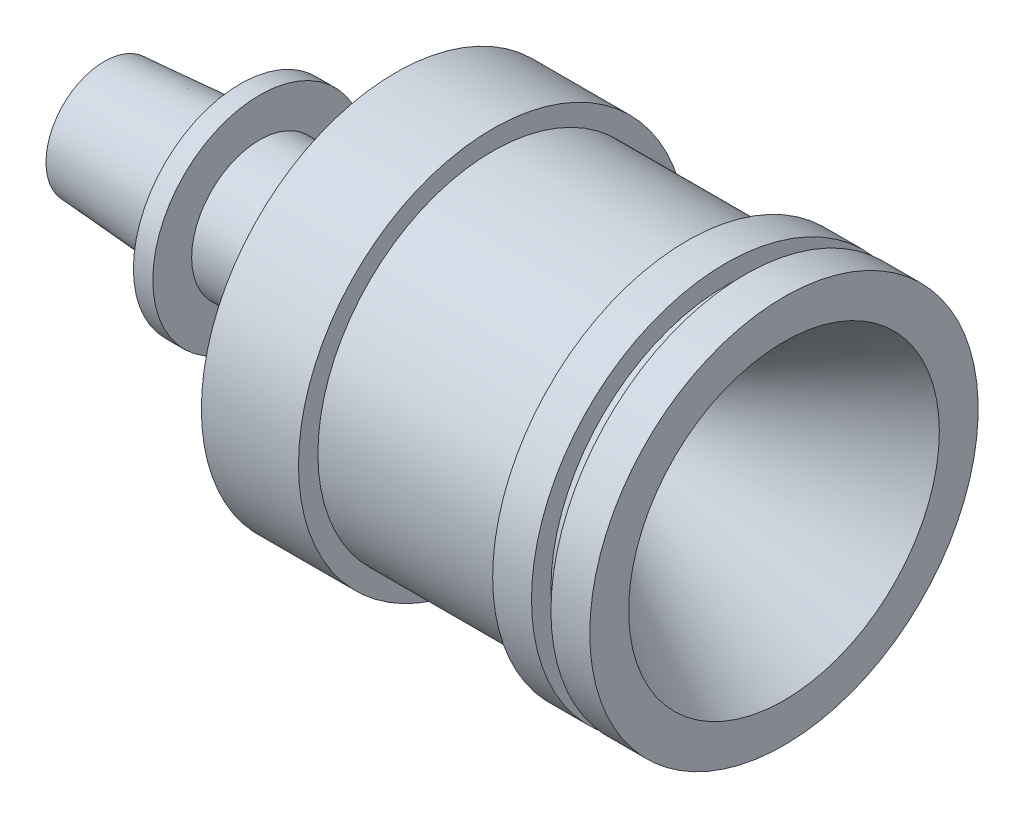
from build123d import *


with BuildPart() as part:
    # Esquisse1 → R_volution1 (revolve)
    with BuildSketch(Plane.XY, mode=Mode.PRIVATE) as r_volution1_sk:
        with BuildLine():
            Line((0, 0), (0, 3))
            Line((0, 3), (7, 3.5))
            Line((7, 3.5), (7, 5.5))
            Line((7, 5.5), (8, 5.5))
            Line((8, 5.5), (8, 3.5))
            Line((8, 3.5), (15, 3.5))
            Line((15, 3.5), (15, 10))
            Line((15, 10), (20, 10))
            Line((20, 10), (20, 9))
            Line((20, 9), (30, 9))
            Line((30, 9), (30, 10))
            Line((30, 10), (32, 10))
            Line((32, 10), (32, 9))
            Line((32, 9), (33, 9))
            Line((33, 9), (33, 10))
            Line((33, 10), (35, 10))
            Line((35, 10), (35, 8))
            Line((35, 8), (24.206602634, 1.272996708))
            ThreePointArc((24.206602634, 1.272996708), (23.688493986, 0.727978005), (23.5, 0))
            Line((23.5, 0), (0, 0))
        make_face()
    revolve(r_volution1_sk.sketch.rotate(Axis((0, 0, 0), (1, 0, 0)), 90), axis=Axis((0, 0, 0), (1, 0, 0)))


solid = part.part
